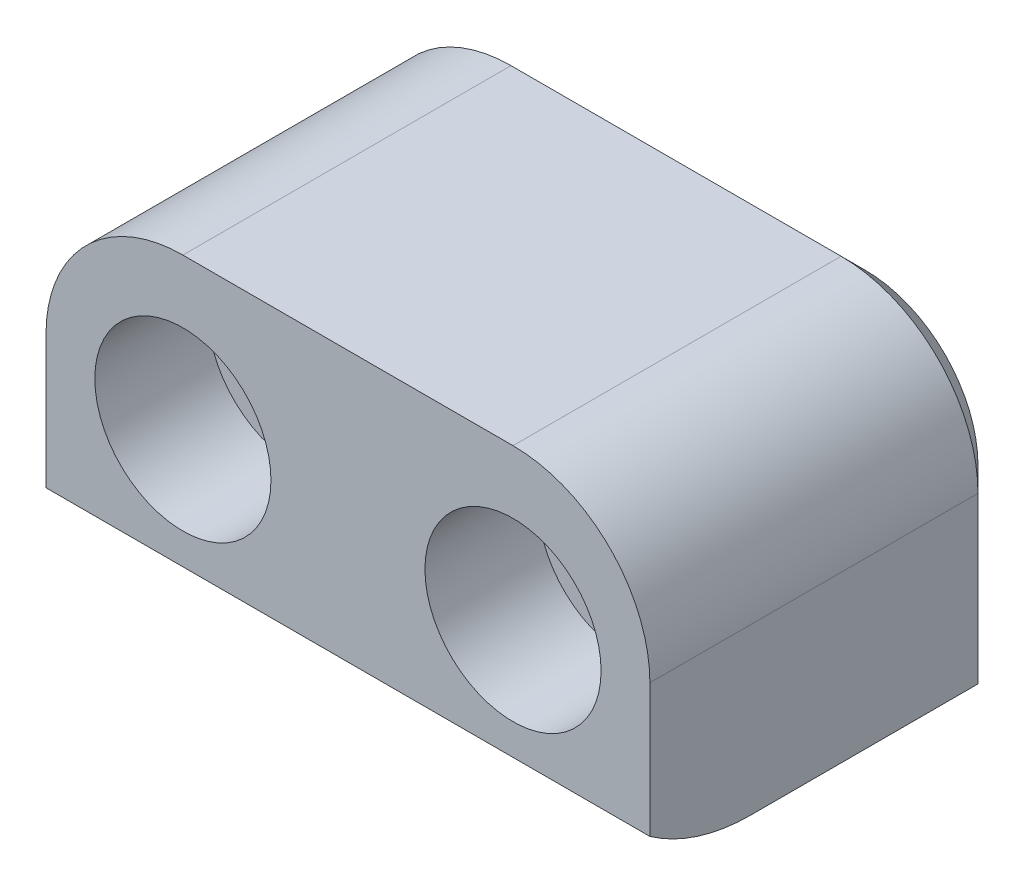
ISO-10303-21;
HEADER;
FILE_DESCRIPTION(('STEP AP214'),'2;1');
FILE_NAME('part.step','',(''),(''),'','','');
FILE_SCHEMA(('AUTOMOTIVE_DESIGN { 1 0 10303 214 1 1 1 1 }'));
ENDSEC;
DATA;
#1=APPLICATION_CONTEXT('core data for automotive mechanical design processes');
#2=APPLICATION_PROTOCOL_DEFINITION('international standard','automotive_design',2000,#1);
#3=PRODUCT_CONTEXT('',#1,'mechanical');
#4=PRODUCT('Part','Part','',(#3));
#5=PRODUCT_RELATED_PRODUCT_CATEGORY('part','',(#4));
#6=PRODUCT_DEFINITION_FORMATION('','',#4);
#7=PRODUCT_DEFINITION_CONTEXT('part definition',#1,'design');
#8=PRODUCT_DEFINITION('design','',#6,#7);
#9=PRODUCT_DEFINITION_SHAPE('','',#8);
#10=(LENGTH_UNIT() NAMED_UNIT(*) SI_UNIT(.MILLI.,.METRE.));
#11=(NAMED_UNIT(*) PLANE_ANGLE_UNIT() SI_UNIT($,.RADIAN.));
#12=(NAMED_UNIT(*) SI_UNIT($,.STERADIAN.) SOLID_ANGLE_UNIT());
#13=UNCERTAINTY_MEASURE_WITH_UNIT(LENGTH_MEASURE(1.E-05),#10,'distance_accuracy_value','');
#14=(GEOMETRIC_REPRESENTATION_CONTEXT(3) GLOBAL_UNCERTAINTY_ASSIGNED_CONTEXT((#13)) GLOBAL_UNIT_ASSIGNED_CONTEXT((#10,
#11,#12)) REPRESENTATION_CONTEXT('',''));
#15=CARTESIAN_POINT('',(0.,0.,0.));
#16=DIRECTION('',(0.,0.,1.));
#17=DIRECTION('',(1.,0.,0.));
#18=AXIS2_PLACEMENT_3D('',#15,#16,#17);
#19=CARTESIAN_POINT('',(0.,19.05,-22.225));
#20=DIRECTION('',(-1.,0.,0.));
#21=DIRECTION('',(0.,-1.,0.));
#22=AXIS2_PLACEMENT_3D('',#19,#20,#21);
#23=PLANE('',#22);
#24=DIRECTION('',(0.,0.,1.));
#25=VECTOR('',#24,1.);
#26=CARTESIAN_POINT('',(0.,10.414,-22.225));
#27=LINE('',#26,#25);
#28=CARTESIAN_POINT('',(0.,10.414,0.));
#29=VERTEX_POINT('',#28);
#30=CARTESIAN_POINT('',(0.,10.414,-20.701));
#31=VERTEX_POINT('',#30);
#32=EDGE_CURVE('E184',#29,#31,#27,.F.);
#33=ORIENTED_EDGE('',*,*,#32,.T.);
#34=DIRECTION('',(0.,-1.,0.));
#35=VECTOR('',#34,1.);
#36=CARTESIAN_POINT('',(0.,0.,-20.701));
#37=LINE('',#36,#35);
#38=CARTESIAN_POINT('',(0.,0.,-20.701));
#39=VERTEX_POINT('',#38);
#40=EDGE_CURVE('E189',#31,#39,#37,.T.);
#41=ORIENTED_EDGE('',*,*,#40,.T.);
#42=DIRECTION('',(0.,0.,1.));
#43=VECTOR('',#42,1.);
#44=CARTESIAN_POINT('',(0.,0.,-22.225));
#45=LINE('',#44,#43);
#46=CARTESIAN_POINT('',(0.,0.,-6.35));
#47=VERTEX_POINT('',#46);
#48=EDGE_CURVE('E124',#39,#47,#45,.T.);
#49=ORIENTED_EDGE('',*,*,#48,.T.);
#50=CARTESIAN_POINT('',(0.,11.0049633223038,-6.35000000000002));
#51=DIRECTION('',(1.,0.,0.));
#52=DIRECTION('',(0.,-1.,0.));
#53=AXIS2_PLACEMENT_3D('',#50,#51,#52);
#54=CIRCLE('',#53,11.0049633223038);
#55=CARTESIAN_POINT('',(0.,2.0168201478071,0.));
#56=VERTEX_POINT('',#55);
#57=EDGE_CURVE('E132',#56,#47,#54,.T.);
#58=ORIENTED_EDGE('',*,*,#57,.F.);
#59=DIRECTION('',(0.,-1.,0.));
#60=VECTOR('',#59,1.);
#61=CARTESIAN_POINT('',(0.,19.05,0.));
#62=LINE('',#61,#60);
#63=EDGE_CURVE('E167',#29,#56,#62,.T.);
#64=ORIENTED_EDGE('',*,*,#63,.F.);
#65=EDGE_LOOP('',(#33,#41,#49,#58,#64));
#66=FACE_BOUND('',#65,.T.);
#67=ADVANCED_FACE('F37',(#66),#23,.T.);
#68=CARTESIAN_POINT('',(0.,19.05,-22.225));
#69=DIRECTION('',(0.,1.,0.));
#70=DIRECTION('',(0.,0.,1.));
#71=AXIS2_PLACEMENT_3D('',#68,#69,#70);
#72=PLANE('',#71);
#73=DIRECTION('',(0.,0.,1.));
#74=VECTOR('',#73,1.);
#75=CARTESIAN_POINT('',(29.464,19.05,-22.225));
#76=LINE('',#75,#74);
#77=CARTESIAN_POINT('',(29.464,19.05,0.));
#78=VERTEX_POINT('',#77);
#79=CARTESIAN_POINT('',(29.464,19.05,-20.701));
#80=VERTEX_POINT('',#79);
#81=EDGE_CURVE('E123',#78,#80,#76,.F.);
#82=ORIENTED_EDGE('',*,*,#81,.T.);
#83=DIRECTION('',(-1.,0.,0.));
#84=VECTOR('',#83,1.);
#85=CARTESIAN_POINT('',(8.636,19.05,-20.701));
#86=LINE('',#85,#84);
#87=CARTESIAN_POINT('',(8.636,19.05,-20.701));
#88=VERTEX_POINT('',#87);
#89=EDGE_CURVE('E207',#80,#88,#86,.T.);
#90=ORIENTED_EDGE('',*,*,#89,.T.);
#91=DIRECTION('',(0.,0.,1.));
#92=VECTOR('',#91,1.);
#93=CARTESIAN_POINT('',(8.636,19.05,-22.225));
#94=LINE('',#93,#92);
#95=CARTESIAN_POINT('',(8.636,19.05,0.));
#96=VERTEX_POINT('',#95);
#97=EDGE_CURVE('E178',#88,#96,#94,.T.);
#98=ORIENTED_EDGE('',*,*,#97,.T.);
#99=DIRECTION('',(-1.,0.,0.));
#100=VECTOR('',#99,1.);
#101=CARTESIAN_POINT('',(0.,19.05,0.));
#102=LINE('',#101,#100);
#103=EDGE_CURVE('E170',#78,#96,#102,.T.);
#104=ORIENTED_EDGE('',*,*,#103,.F.);
#105=EDGE_LOOP('',(#82,#90,#98,#104));
#106=FACE_BOUND('',#105,.T.);
#107=ADVANCED_FACE('F250',(#106),#72,.T.);
#108=CARTESIAN_POINT('',(38.1,19.05,-22.225));
#109=DIRECTION('',(1.,0.,0.));
#110=DIRECTION('',(0.,1.,0.));
#111=AXIS2_PLACEMENT_3D('',#108,#109,#110);
#112=PLANE('',#111);
#113=DIRECTION('',(0.,0.,1.));
#114=VECTOR('',#113,1.);
#115=CARTESIAN_POINT('',(38.1,0.,-22.225));
#116=LINE('',#115,#114);
#117=CARTESIAN_POINT('',(38.1,0.,-20.701));
#118=VERTEX_POINT('',#117);
#119=CARTESIAN_POINT('',(38.1,0.,-6.35));
#120=VERTEX_POINT('',#119);
#121=EDGE_CURVE('E114',#118,#120,#116,.T.);
#122=ORIENTED_EDGE('',*,*,#121,.F.);
#123=DIRECTION('',(0.,1.,0.));
#124=VECTOR('',#123,1.);
#125=CARTESIAN_POINT('',(38.1,10.414,-20.701));
#126=LINE('',#125,#124);
#127=CARTESIAN_POINT('',(38.1,10.414,-20.701));
#128=VERTEX_POINT('',#127);
#129=EDGE_CURVE('E46',#118,#128,#126,.T.);
#130=ORIENTED_EDGE('',*,*,#129,.T.);
#131=DIRECTION('',(0.,0.,1.));
#132=VECTOR('',#131,1.);
#133=CARTESIAN_POINT('',(38.1,10.414,-22.225));
#134=LINE('',#133,#132);
#135=CARTESIAN_POINT('',(38.1,10.414,0.));
#136=VERTEX_POINT('',#135);
#137=EDGE_CURVE('E187',#128,#136,#134,.T.);
#138=ORIENTED_EDGE('',*,*,#137,.T.);
#139=DIRECTION('',(0.,1.,0.));
#140=VECTOR('',#139,1.);
#141=CARTESIAN_POINT('',(38.1,19.05,0.));
#142=LINE('',#141,#140);
#143=CARTESIAN_POINT('',(38.1,2.01682014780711,0.));
#144=VERTEX_POINT('',#143);
#145=EDGE_CURVE('E139',#144,#136,#142,.T.);
#146=ORIENTED_EDGE('',*,*,#145,.F.);
#147=CARTESIAN_POINT('',(38.1,11.0049633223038,-6.35000000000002));
#148=DIRECTION('',(1.,0.,0.));
#149=DIRECTION('',(0.,-1.,0.));
#150=AXIS2_PLACEMENT_3D('',#147,#148,#149);
#151=CIRCLE('',#150,11.0049633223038);
#152=EDGE_CURVE('E129',#144,#120,#151,.T.);
#153=ORIENTED_EDGE('',*,*,#152,.T.);
#154=EDGE_LOOP('',(#122,#130,#138,#146,#153));
#155=FACE_BOUND('',#154,.T.);
#156=ADVANCED_FACE('F137',(#155),#112,.T.);
#157=CARTESIAN_POINT('',(0.,0.,-22.225));
#158=DIRECTION('',(0.,-1.,0.));
#159=DIRECTION('',(0.,0.,-1.));
#160=AXIS2_PLACEMENT_3D('',#157,#158,#159);
#161=PLANE('',#160);
#162=ORIENTED_EDGE('',*,*,#48,.F.);
#163=DIRECTION('',(0.707106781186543,0.,-0.707106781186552));
#164=VECTOR('',#163,1.);
#165=CARTESIAN_POINT('',(0.762000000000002,0.,-21.463));
#166=LINE('',#165,#164);
#167=CARTESIAN_POINT('',(1.52399999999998,0.,-22.225));
#168=VERTEX_POINT('',#167);
#169=EDGE_CURVE('E193',#39,#168,#166,.T.);
#170=ORIENTED_EDGE('',*,*,#169,.T.);
#171=DIRECTION('',(1.,0.,0.));
#172=VECTOR('',#171,1.);
#173=CARTESIAN_POINT('',(0.,0.,-22.225));
#174=LINE('',#173,#172);
#175=CARTESIAN_POINT('',(36.576,0.,-22.225));
#176=VERTEX_POINT('',#175);
#177=EDGE_CURVE('E168',#168,#176,#174,.T.);
#178=ORIENTED_EDGE('',*,*,#177,.T.);
#179=DIRECTION('',(0.707106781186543,0.,0.707106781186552));
#180=VECTOR('',#179,1.);
#181=CARTESIAN_POINT('',(18.2880000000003,0.,-40.513));
#182=LINE('',#181,#180);
#183=EDGE_CURVE('E121',#176,#118,#182,.T.);
#184=ORIENTED_EDGE('',*,*,#183,.T.);
#185=ORIENTED_EDGE('',*,*,#121,.T.);
#186=DIRECTION('',(-1.,0.,0.));
#187=VECTOR('',#186,1.);
#188=CARTESIAN_POINT('',(38.1,0.,-6.35));
#189=LINE('',#188,#187);
#190=EDGE_CURVE('E118',#120,#47,#189,.T.);
#191=ORIENTED_EDGE('',*,*,#190,.T.);
#192=EDGE_LOOP('',(#162,#170,#178,#184,#185,#191));
#193=FACE_BOUND('',#192,.T.);
#194=ADVANCED_FACE('F117',(#193),#161,.T.);
#195=CARTESIAN_POINT('',(0.,0.,-22.225));
#196=DIRECTION('',(0.,0.,1.));
#197=DIRECTION('',(1.,0.,0.));
#198=AXIS2_PLACEMENT_3D('',#195,#196,#197);
#199=PLANE('',#198);
#200=ORIENTED_EDGE('',*,*,#177,.F.);
#201=DIRECTION('',(0.,1.,0.));
#202=VECTOR('',#201,1.);
#203=CARTESIAN_POINT('',(1.52399999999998,10.414,-22.225));
#204=LINE('',#203,#202);
#205=CARTESIAN_POINT('',(1.52399999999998,10.414,-22.225));
#206=VERTEX_POINT('',#205);
#207=EDGE_CURVE('E203',#168,#206,#204,.T.);
#208=ORIENTED_EDGE('',*,*,#207,.T.);
#209=CARTESIAN_POINT('',(8.636,10.414,-22.225));
#210=DIRECTION('',(0.,0.,1.));
#211=DIRECTION('',(1.,0.,0.));
#212=AXIS2_PLACEMENT_3D('',#209,#210,#211);
#213=CIRCLE('',#212,7.11200000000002);
#214=CARTESIAN_POINT('',(8.636,17.526,-22.225));
#215=VERTEX_POINT('',#214);
#216=EDGE_CURVE('E201',#206,#215,#213,.F.);
#217=ORIENTED_EDGE('',*,*,#216,.T.);
#218=DIRECTION('',(1.,0.,0.));
#219=VECTOR('',#218,1.);
#220=CARTESIAN_POINT('',(29.464,17.526,-22.225));
#221=LINE('',#220,#219);
#222=CARTESIAN_POINT('',(29.464,17.526,-22.225));
#223=VERTEX_POINT('',#222);
#224=EDGE_CURVE('E199',#215,#223,#221,.T.);
#225=ORIENTED_EDGE('',*,*,#224,.T.);
#226=CARTESIAN_POINT('',(29.464,10.414,-22.225));
#227=DIRECTION('',(0.,0.,1.));
#228=DIRECTION('',(1.,0.,0.));
#229=AXIS2_PLACEMENT_3D('',#226,#227,#228);
#230=CIRCLE('',#229,7.11200000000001);
#231=CARTESIAN_POINT('',(36.576,10.414,-22.225));
#232=VERTEX_POINT('',#231);
#233=EDGE_CURVE('E195',#223,#232,#230,.F.);
#234=ORIENTED_EDGE('',*,*,#233,.T.);
#235=DIRECTION('',(0.,-1.,0.));
#236=VECTOR('',#235,1.);
#237=CARTESIAN_POINT('',(36.576,0.,-22.225));
#238=LINE('',#237,#236);
#239=EDGE_CURVE('E197',#232,#176,#238,.T.);
#240=ORIENTED_EDGE('',*,*,#239,.T.);
#241=EDGE_LOOP('',(#200,#208,#217,#225,#234,#240));
#242=FACE_BOUND('',#241,.T.);
#243=CARTESIAN_POINT('',(8.636,9.525,-22.225));
#244=DIRECTION('',(0.,0.,1.));
#245=DIRECTION('',(1.,0.,0.));
#246=AXIS2_PLACEMENT_3D('',#243,#244,#245);
#247=CIRCLE('',#246,3.2639);
#248=CARTESIAN_POINT('',(11.8999,9.525,-22.225));
#249=VERTEX_POINT('',#248);
#250=EDGE_CURVE('E152',#249,#249,#247,.T.);
#251=ORIENTED_EDGE('',*,*,#250,.T.);
#252=EDGE_LOOP('',(#251));
#253=FACE_BOUND('',#252,.T.);
#254=CARTESIAN_POINT('',(29.464,9.525,-22.225));
#255=DIRECTION('',(0.,0.,1.));
#256=DIRECTION('',(1.,0.,0.));
#257=AXIS2_PLACEMENT_3D('',#254,#255,#256);
#258=CIRCLE('',#257,3.26389999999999);
#259=CARTESIAN_POINT('',(32.7279,9.525,-22.225));
#260=VERTEX_POINT('',#259);
#261=EDGE_CURVE('E164',#260,#260,#258,.T.);
#262=ORIENTED_EDGE('',*,*,#261,.T.);
#263=EDGE_LOOP('',(#262));
#264=FACE_BOUND('',#263,.T.);
#265=ADVANCED_FACE('F230',(#242,#253,#264),#199,.F.);
#266=CARTESIAN_POINT('',(0.,0.,0.));
#267=DIRECTION('',(0.,0.,1.));
#268=DIRECTION('',(1.,0.,0.));
#269=AXIS2_PLACEMENT_3D('',#266,#267,#268);
#270=PLANE('',#269);
#271=DIRECTION('',(-1.,0.,0.));
#272=VECTOR('',#271,1.);
#273=CARTESIAN_POINT('',(38.1,2.0168201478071,0.));
#274=LINE('',#273,#272);
#275=EDGE_CURVE('E134',#144,#56,#274,.T.);
#276=ORIENTED_EDGE('',*,*,#275,.F.);
#277=ORIENTED_EDGE('',*,*,#145,.T.);
#278=CARTESIAN_POINT('',(29.464,10.414,0.));
#279=DIRECTION('',(0.,0.,1.));
#280=DIRECTION('',(1.,0.,0.));
#281=AXIS2_PLACEMENT_3D('',#278,#279,#280);
#282=CIRCLE('',#281,8.636);
#283=EDGE_CURVE('E180',#136,#78,#282,.T.);
#284=ORIENTED_EDGE('',*,*,#283,.T.);
#285=ORIENTED_EDGE('',*,*,#103,.T.);
#286=CARTESIAN_POINT('',(8.636,10.414,0.));
#287=DIRECTION('',(0.,0.,1.));
#288=DIRECTION('',(1.,0.,0.));
#289=AXIS2_PLACEMENT_3D('',#286,#287,#288);
#290=CIRCLE('',#289,8.636);
#291=EDGE_CURVE('E182',#96,#29,#290,.T.);
#292=ORIENTED_EDGE('',*,*,#291,.T.);
#293=ORIENTED_EDGE('',*,*,#63,.T.);
#294=EDGE_LOOP('',(#276,#277,#284,#285,#292,#293));
#295=FACE_BOUND('',#294,.T.);
#296=CARTESIAN_POINT('',(8.636,9.525,0.));
#297=DIRECTION('',(0.,0.,1.));
#298=DIRECTION('',(1.,0.,0.));
#299=AXIS2_PLACEMENT_3D('',#296,#297,#298);
#300=CIRCLE('',#299,5.55625);
#301=CARTESIAN_POINT('',(14.19225,9.525,0.));
#302=VERTEX_POINT('',#301);
#303=EDGE_CURVE('E133',#302,#302,#300,.T.);
#304=ORIENTED_EDGE('',*,*,#303,.F.);
#305=EDGE_LOOP('',(#304));
#306=FACE_BOUND('',#305,.T.);
#307=CARTESIAN_POINT('',(29.464,9.525,0.));
#308=DIRECTION('',(0.,0.,1.));
#309=DIRECTION('',(1.,0.,0.));
#310=AXIS2_PLACEMENT_3D('',#307,#308,#309);
#311=CIRCLE('',#310,5.55625);
#312=CARTESIAN_POINT('',(35.02025,9.525,0.));
#313=VERTEX_POINT('',#312);
#314=EDGE_CURVE('E155',#313,#313,#311,.T.);
#315=ORIENTED_EDGE('',*,*,#314,.F.);
#316=EDGE_LOOP('',(#315));
#317=FACE_BOUND('',#316,.T.);
#318=ADVANCED_FACE('F254',(#295,#306,#317),#270,.T.);
#319=CARTESIAN_POINT('',(8.636,10.414,-22.225));
#320=DIRECTION('',(0.,0.,1.));
#321=DIRECTION('',(1.,0.,0.));
#322=AXIS2_PLACEMENT_3D('',#319,#320,#321);
#323=CYLINDRICAL_SURFACE('',#322,8.636);
#324=ORIENTED_EDGE('',*,*,#97,.F.);
#325=CARTESIAN_POINT('',(8.636,10.414,-20.701));
#326=DIRECTION('',(0.,0.,1.));
#327=DIRECTION('',(1.,0.,0.));
#328=AXIS2_PLACEMENT_3D('',#325,#326,#327);
#329=CIRCLE('',#328,8.636);
#330=EDGE_CURVE('E205',#88,#31,#329,.T.);
#331=ORIENTED_EDGE('',*,*,#330,.T.);
#332=ORIENTED_EDGE('',*,*,#32,.F.);
#333=ORIENTED_EDGE('',*,*,#291,.F.);
#334=EDGE_LOOP('',(#324,#331,#332,#333));
#335=FACE_BOUND('',#334,.T.);
#336=ADVANCED_FACE('F252',(#335),#323,.T.);
#337=CARTESIAN_POINT('',(29.464,10.414,-22.225));
#338=DIRECTION('',(0.,0.,1.));
#339=DIRECTION('',(1.,0.,0.));
#340=AXIS2_PLACEMENT_3D('',#337,#338,#339);
#341=CYLINDRICAL_SURFACE('',#340,8.636);
#342=ORIENTED_EDGE('',*,*,#137,.F.);
#343=CARTESIAN_POINT('',(29.464,10.414,-20.701));
#344=DIRECTION('',(0.,0.,1.));
#345=DIRECTION('',(1.,0.,0.));
#346=AXIS2_PLACEMENT_3D('',#343,#344,#345);
#347=CIRCLE('',#346,8.636);
#348=EDGE_CURVE('E11',#128,#80,#347,.T.);
#349=ORIENTED_EDGE('',*,*,#348,.T.);
#350=ORIENTED_EDGE('',*,*,#81,.F.);
#351=ORIENTED_EDGE('',*,*,#283,.F.);
#352=EDGE_LOOP('',(#342,#349,#350,#351));
#353=FACE_BOUND('',#352,.T.);
#354=ADVANCED_FACE('F257',(#353),#341,.T.);
#355=CARTESIAN_POINT('',(29.464,9.525,0.));
#356=DIRECTION('',(0.,0.,1.));
#357=DIRECTION('',(1.,0.,0.));
#358=AXIS2_PLACEMENT_3D('',#355,#356,#357);
#359=CYLINDRICAL_SURFACE('',#358,3.2639);
#360=ORIENTED_EDGE('',*,*,#261,.F.);
#361=EDGE_LOOP('',(#360));
#362=FACE_BOUND('',#361,.T.);
#363=CARTESIAN_POINT('',(29.464,9.525,-7.14502));
#364=DIRECTION('',(0.,0.,1.));
#365=DIRECTION('',(1.,0.,0.));
#366=AXIS2_PLACEMENT_3D('',#363,#364,#365);
#367=CIRCLE('',#366,3.2639);
#368=CARTESIAN_POINT('',(32.7279,9.525,-7.14502));
#369=VERTEX_POINT('',#368);
#370=EDGE_CURVE('E161',#369,#369,#367,.T.);
#371=ORIENTED_EDGE('',*,*,#370,.T.);
#372=EDGE_LOOP('',(#371));
#373=FACE_BOUND('',#372,.T.);
#374=ADVANCED_FACE('F259',(#362,#373),#359,.F.);
#375=CARTESIAN_POINT('',(32.7279,9.525,-7.14502));
#376=DIRECTION('',(0.,0.,-1.));
#377=DIRECTION('',(-1.,0.,0.));
#378=AXIS2_PLACEMENT_3D('',#375,#376,#377);
#379=PLANE('',#378);
#380=ORIENTED_EDGE('',*,*,#370,.F.);
#381=EDGE_LOOP('',(#380));
#382=FACE_BOUND('',#381,.T.);
#383=CARTESIAN_POINT('',(29.464,9.525,-7.14502));
#384=DIRECTION('',(0.,0.,1.));
#385=DIRECTION('',(1.,0.,0.));
#386=AXIS2_PLACEMENT_3D('',#383,#384,#385);
#387=CIRCLE('',#386,5.55625);
#388=CARTESIAN_POINT('',(35.02025,9.525,-7.14502));
#389=VERTEX_POINT('',#388);
#390=EDGE_CURVE('E158',#389,#389,#387,.T.);
#391=ORIENTED_EDGE('',*,*,#390,.T.);
#392=EDGE_LOOP('',(#391));
#393=FACE_BOUND('',#392,.T.);
#394=ADVANCED_FACE('F265',(#382,#393),#379,.F.);
#395=CARTESIAN_POINT('',(29.464,9.525,0.));
#396=DIRECTION('',(0.,0.,1.));
#397=DIRECTION('',(1.,0.,0.));
#398=AXIS2_PLACEMENT_3D('',#395,#396,#397);
#399=CYLINDRICAL_SURFACE('',#398,5.55625);
#400=ORIENTED_EDGE('',*,*,#390,.F.);
#401=EDGE_LOOP('',(#400));
#402=FACE_BOUND('',#401,.T.);
#403=ORIENTED_EDGE('',*,*,#314,.T.);
#404=EDGE_LOOP('',(#403));
#405=FACE_BOUND('',#404,.T.);
#406=ADVANCED_FACE('F287',(#402,#405),#399,.F.);
#407=CARTESIAN_POINT('',(8.636,9.525,0.));
#408=DIRECTION('',(0.,0.,1.));
#409=DIRECTION('',(1.,0.,0.));
#410=AXIS2_PLACEMENT_3D('',#407,#408,#409);
#411=CYLINDRICAL_SURFACE('',#410,3.2639);
#412=ORIENTED_EDGE('',*,*,#250,.F.);
#413=EDGE_LOOP('',(#412));
#414=FACE_BOUND('',#413,.T.);
#415=CARTESIAN_POINT('',(8.636,9.525,-7.14502));
#416=DIRECTION('',(0.,0.,1.));
#417=DIRECTION('',(1.,0.,0.));
#418=AXIS2_PLACEMENT_3D('',#415,#416,#417);
#419=CIRCLE('',#418,3.2639);
#420=CARTESIAN_POINT('',(11.8999,9.525,-7.14502));
#421=VERTEX_POINT('',#420);
#422=EDGE_CURVE('E149',#421,#421,#419,.T.);
#423=ORIENTED_EDGE('',*,*,#422,.T.);
#424=EDGE_LOOP('',(#423));
#425=FACE_BOUND('',#424,.T.);
#426=ADVANCED_FACE('F291',(#414,#425),#411,.F.);
#427=CARTESIAN_POINT('',(11.8999,9.525,-7.14502));
#428=DIRECTION('',(0.,0.,-1.));
#429=DIRECTION('',(-1.,0.,0.));
#430=AXIS2_PLACEMENT_3D('',#427,#428,#429);
#431=PLANE('',#430);
#432=ORIENTED_EDGE('',*,*,#422,.F.);
#433=EDGE_LOOP('',(#432));
#434=FACE_BOUND('',#433,.T.);
#435=CARTESIAN_POINT('',(8.636,9.525,-7.14502));
#436=DIRECTION('',(0.,0.,1.));
#437=DIRECTION('',(1.,0.,0.));
#438=AXIS2_PLACEMENT_3D('',#435,#436,#437);
#439=CIRCLE('',#438,5.55625);
#440=CARTESIAN_POINT('',(14.19225,9.525,-7.14502));
#441=VERTEX_POINT('',#440);
#442=EDGE_CURVE('E146',#441,#441,#439,.T.);
#443=ORIENTED_EDGE('',*,*,#442,.T.);
#444=EDGE_LOOP('',(#443));
#445=FACE_BOUND('',#444,.T.);
#446=ADVANCED_FACE('F295',(#434,#445),#431,.F.);
#447=CARTESIAN_POINT('',(8.636,9.525,0.));
#448=DIRECTION('',(0.,0.,1.));
#449=DIRECTION('',(1.,0.,0.));
#450=AXIS2_PLACEMENT_3D('',#447,#448,#449);
#451=CYLINDRICAL_SURFACE('',#450,5.55625);
#452=ORIENTED_EDGE('',*,*,#442,.F.);
#453=EDGE_LOOP('',(#452));
#454=FACE_BOUND('',#453,.T.);
#455=ORIENTED_EDGE('',*,*,#303,.T.);
#456=EDGE_LOOP('',(#455));
#457=FACE_BOUND('',#456,.T.);
#458=ADVANCED_FACE('F299',(#454,#457),#451,.F.);
#459=CARTESIAN_POINT('',(38.1,11.0049633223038,-6.35000000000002));
#460=DIRECTION('',(-1.,0.,0.));
#461=DIRECTION('',(0.,-1.,0.));
#462=AXIS2_PLACEMENT_3D('',#459,#460,#461);
#463=CYLINDRICAL_SURFACE('',#462,11.0049633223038);
#464=ORIENTED_EDGE('',*,*,#57,.T.);
#465=ORIENTED_EDGE('',*,*,#190,.F.);
#466=ORIENTED_EDGE('',*,*,#152,.F.);
#467=ORIENTED_EDGE('',*,*,#275,.T.);
#468=EDGE_LOOP('',(#464,#465,#466,#467));
#469=FACE_BOUND('',#468,.T.);
#470=ADVANCED_FACE('F128',(#469),#463,.T.);
#471=CARTESIAN_POINT('',(38.1,19.05,-20.701));
#472=DIRECTION('',(0.707106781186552,0.,-0.707106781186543));
#473=DIRECTION('',(0.,-1.,0.));
#474=AXIS2_PLACEMENT_3D('',#471,#472,#473);
#475=PLANE('',#474);
#476=ORIENTED_EDGE('',*,*,#183,.F.);
#477=ORIENTED_EDGE('',*,*,#239,.F.);
#478=DIRECTION('',(-0.707106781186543,0.,-0.707106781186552));
#479=VECTOR('',#478,1.);
#480=CARTESIAN_POINT('',(38.1,10.414,-20.701));
#481=LINE('',#480,#479);
#482=EDGE_CURVE('E41',#128,#232,#481,.T.);
#483=ORIENTED_EDGE('',*,*,#482,.F.);
#484=ORIENTED_EDGE('',*,*,#129,.F.);
#485=EDGE_LOOP('',(#476,#477,#483,#484));
#486=FACE_BOUND('',#485,.T.);
#487=ADVANCED_FACE('F39',(#486),#475,.T.);
#488=CARTESIAN_POINT('',(29.464,10.414,-22.225));
#489=DIRECTION('',(0.,0.,1.));
#490=DIRECTION('',(1.,0.,0.));
#491=AXIS2_PLACEMENT_3D('',#488,#489,#490);
#492=CONICAL_SURFACE('',#491,7.11200000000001,0.785398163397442);
#493=ORIENTED_EDGE('',*,*,#482,.T.);
#494=ORIENTED_EDGE('',*,*,#233,.F.);
#495=DIRECTION('',(0.,-0.707106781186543,-0.707106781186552));
#496=VECTOR('',#495,1.);
#497=CARTESIAN_POINT('',(29.464,19.05,-20.701));
#498=LINE('',#497,#496);
#499=EDGE_CURVE('E215',#80,#223,#498,.T.);
#500=ORIENTED_EDGE('',*,*,#499,.F.);
#501=ORIENTED_EDGE('',*,*,#348,.F.);
#502=EDGE_LOOP('',(#493,#494,#500,#501));
#503=FACE_BOUND('',#502,.T.);
#504=ADVANCED_FACE('F225',(#503),#492,.T.);
#505=CARTESIAN_POINT('',(0.,19.05,-20.701));
#506=DIRECTION('',(0.,0.707106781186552,-0.707106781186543));
#507=DIRECTION('',(1.,0.,0.));
#508=AXIS2_PLACEMENT_3D('',#505,#506,#507);
#509=PLANE('',#508);
#510=ORIENTED_EDGE('',*,*,#499,.T.);
#511=ORIENTED_EDGE('',*,*,#224,.F.);
#512=DIRECTION('',(0.,-0.707106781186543,-0.707106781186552));
#513=VECTOR('',#512,1.);
#514=CARTESIAN_POINT('',(8.636,19.05,-20.701));
#515=LINE('',#514,#513);
#516=EDGE_CURVE('E213',#88,#215,#515,.T.);
#517=ORIENTED_EDGE('',*,*,#516,.F.);
#518=ORIENTED_EDGE('',*,*,#89,.F.);
#519=EDGE_LOOP('',(#510,#511,#517,#518));
#520=FACE_BOUND('',#519,.T.);
#521=ADVANCED_FACE('F247',(#520),#509,.T.);
#522=CARTESIAN_POINT('',(8.636,10.414,-22.225));
#523=DIRECTION('',(0.,0.,1.));
#524=DIRECTION('',(1.,0.,0.));
#525=AXIS2_PLACEMENT_3D('',#522,#523,#524);
#526=CONICAL_SURFACE('',#525,7.11200000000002,0.785398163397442);
#527=ORIENTED_EDGE('',*,*,#516,.T.);
#528=ORIENTED_EDGE('',*,*,#216,.F.);
#529=DIRECTION('',(0.707106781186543,0.,-0.707106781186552));
#530=VECTOR('',#529,1.);
#531=CARTESIAN_POINT('',(0.,10.414,-20.701));
#532=LINE('',#531,#530);
#533=EDGE_CURVE('E210',#31,#206,#532,.T.);
#534=ORIENTED_EDGE('',*,*,#533,.F.);
#535=ORIENTED_EDGE('',*,*,#330,.F.);
#536=EDGE_LOOP('',(#527,#528,#534,#535));
#537=FACE_BOUND('',#536,.T.);
#538=ADVANCED_FACE('F245',(#537),#526,.T.);
#539=CARTESIAN_POINT('',(0.,19.05,-20.701));
#540=DIRECTION('',(-0.707106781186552,0.,-0.707106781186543));
#541=DIRECTION('',(0.,1.,0.));
#542=AXIS2_PLACEMENT_3D('',#539,#540,#541);
#543=PLANE('',#542);
#544=ORIENTED_EDGE('',*,*,#533,.T.);
#545=ORIENTED_EDGE('',*,*,#207,.F.);
#546=ORIENTED_EDGE('',*,*,#169,.F.);
#547=ORIENTED_EDGE('',*,*,#40,.F.);
#548=EDGE_LOOP('',(#544,#545,#546,#547));
#549=FACE_BOUND('',#548,.T.);
#550=ADVANCED_FACE('F235',(#549),#543,.T.);
#551=CLOSED_SHELL('',(#67,#107,#156,#194,#265,#318,#336,#354,#374,#394,#406,#426,#446,#458,#470,
#487,#504,#521,#538,#550));
#552=MANIFOLD_SOLID_BREP('B2',#551);
#553=ADVANCED_BREP_SHAPE_REPRESENTATION('',(#18,#552),#14);
#554=SHAPE_DEFINITION_REPRESENTATION(#9,#553);
ENDSEC;
END-ISO-10303-21;
